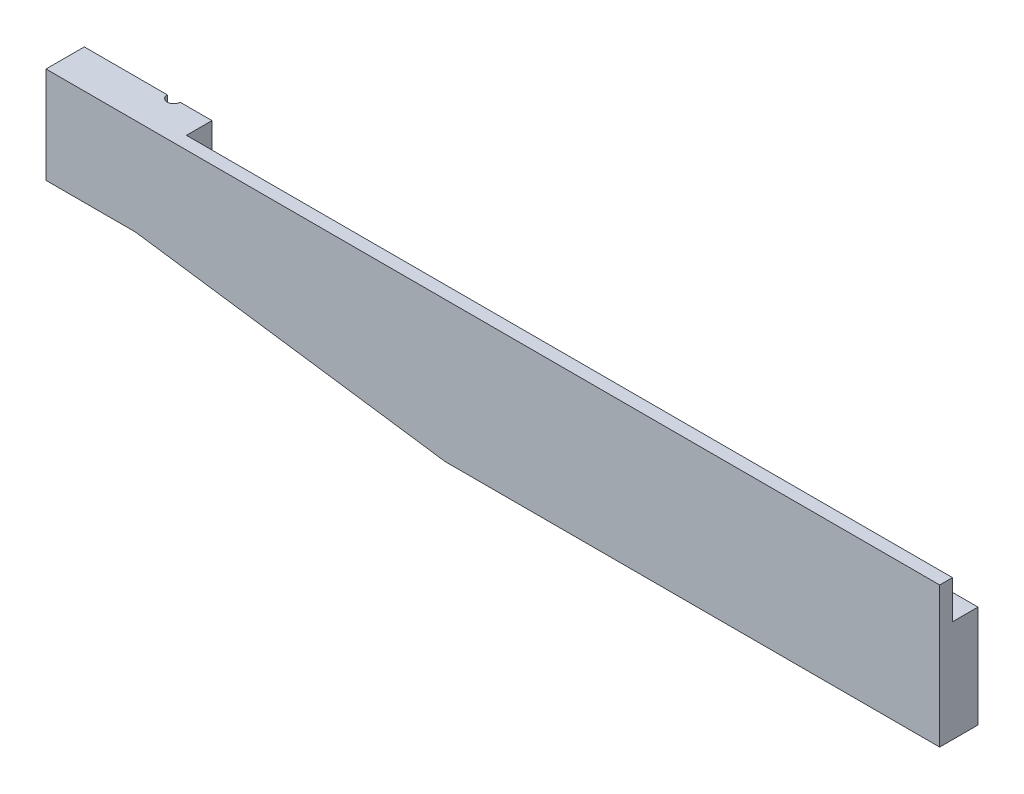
from build123d import *

# Parameters (mm, degrees)
SKETCH1_W               = 85.725
SKETCH1_H               = 2.54
BOSS_EXTRUDE1_DEPTH     = 69.85
CUT_EXTRUDE1_DEPTH      = 498.422296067
CUT_EXTRUDE1_DEPTH_BACK = 498.422296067
SKETCH3_W               = 12.7
SKETCH3_H               = 19.05
CUT_EXTRUDE2_DEPTH      = 381
CUT_EXTRUDE3_DEPTH      = 498.422296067
CUT_EXTRUDE3_DEPTH_BACK = 498.422296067
SKETCH5_W               = 19.05
SKETCH5_H               = 47.993709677
BOSS_EXTRUDE2_DEPTH     = 44.45
CUT_EXTRUDE5_REACH      = 452.358
SKETCH8_R               = 3.175


with BuildPart() as part:
    # Sketch1 → Boss-Extrude1 (new body)
    with BuildSketch(Plane(origin=(0, 0, 0), x_dir=(1, 0, 0), z_dir=(0, 1, 0))):
        with Locations((-68.2625, 1.27)):
            Rectangle(SKETCH1_W, SKETCH1_H)
        Polygon((-111.125, 2.54), (-25.4, 2.54), (-25.4, 0), (0, 0), (0, 19.05), (-25.4, 19.05), (-492.125, 19.05), (-492.125, 0), (-111.125, 0), align=None)
    extrude(amount=BOSS_EXTRUDE1_DEPTH)

    # Sketch2 → Cut-Extrude1 (cut, two sides: drawn at the far end of the back side and taken through both)
    with BuildSketch(Plane.XY.offset(-CUT_EXTRUDE1_DEPTH_BACK)):
        Polygon((-1478.95977109, 174.991870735), (-492.125, 34.925), (-246.0625, 0), (740.77227109, -140.066870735), (460.638529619, -2113.736412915), (-1759.09351256, -1798.677671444), align=None)
    extrude(amount=CUT_EXTRUDE1_DEPTH + CUT_EXTRUDE1_DEPTH_BACK, mode=Mode.SUBTRACT)

    # Sketch3 → Cut-Extrude2 (cut)
    with BuildSketch(Plane(origin=(0, 0, 0), x_dir=(0, 0, -1), z_dir=(1, 0, 0))):
        with Locations((12.7, 60.325)):
            Rectangle(SKETCH3_W, SKETCH3_H)
    extrude(amount=-CUT_EXTRUDE2_DEPTH, mode=Mode.SUBTRACT)

    # Sketch4 → Cut-Extrude3 (cut, two sides: drawn at the far end of the back side and taken through both)
    with BuildSketch(Plane(origin=(0, 69.85, 0), x_dir=(-1, 0, 0), z_dir=(0, 1, 0)).offset(-CUT_EXTRUDE3_DEPTH_BACK)):
        Polygon((400.05, 811.006629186), (400.05, 0), (400.05, -19.05), (400.05, -830.056629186), (2022.063258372, -830.056629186), (2022.063258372, 811.006629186), align=None)
    extrude(amount=CUT_EXTRUDE3_DEPTH + CUT_EXTRUDE3_DEPTH_BACK, mode=Mode.SUBTRACT)

    # Sketch5 → Boss-Extrude2 (add)
    with BuildSketch(Plane.ZY.offset(400.05)):
        with Locations((-9.525, 45.853145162)):
            Rectangle(SKETCH5_W, SKETCH5_H)
    extrude(amount=BOSS_EXTRUDE2_DEPTH)

    # Sketch8 → Cut-Extrude5 (cut, up to next)
    with BuildSketch(Plane(origin=(0, 69.85, 0), x_dir=(1, 0, 0), z_dir=(0, 1, 0)), mode=Mode.PRIVATE) as cut_extrude5_sk1:
        with Locations((-400.05, 19.05)):
            Circle(SKETCH8_R)
    cut_extrude5_tool1 = extrude(cut_extrude5_sk1.sketch, amount=-CUT_EXTRUDE5_REACH, mode=Mode.PRIVATE) & part.part
    add(cut_extrude5_tool1.solids().sort_by_distance((-400.05, 69.85, -19.05))[0], mode=Mode.SUBTRACT)


solid = part.part
